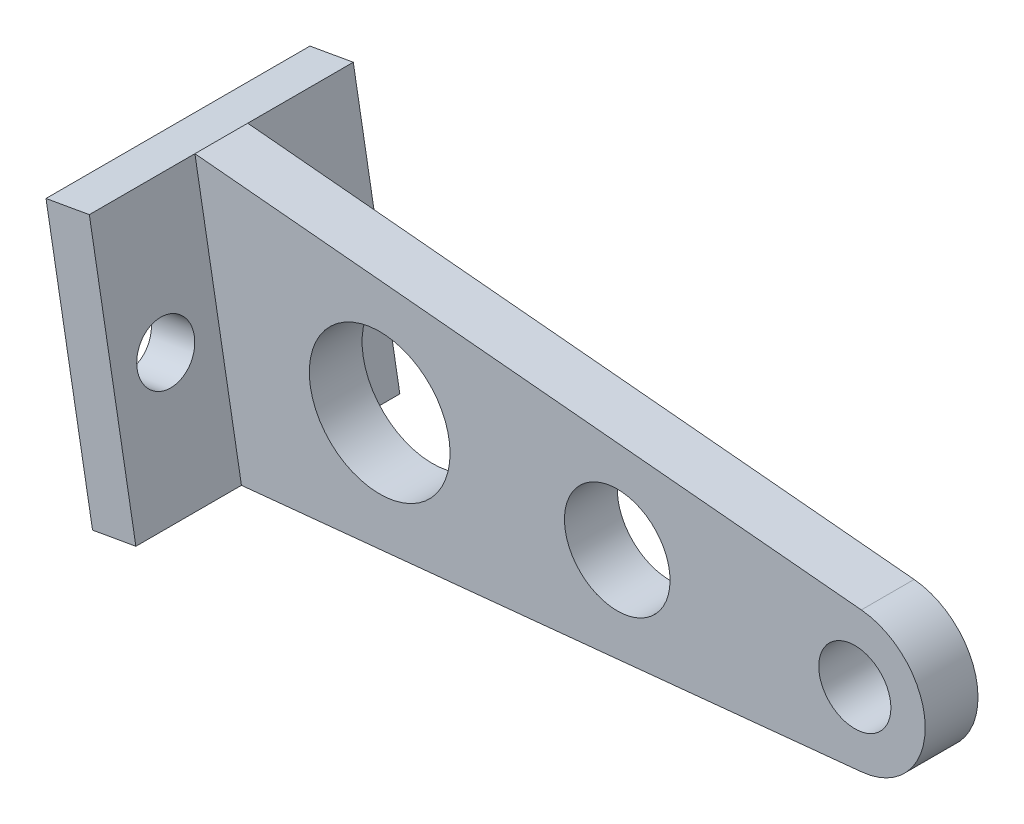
ISO-10303-21;
HEADER;
FILE_DESCRIPTION(('STEP AP214'),'2;1');
FILE_NAME('part.step','',(''),(''),'','','');
FILE_SCHEMA(('AUTOMOTIVE_DESIGN { 1 0 10303 214 1 1 1 1 }'));
ENDSEC;
DATA;
#1=APPLICATION_CONTEXT('core data for automotive mechanical design processes');
#2=APPLICATION_PROTOCOL_DEFINITION('international standard','automotive_design',2000,#1);
#3=PRODUCT_CONTEXT('',#1,'mechanical');
#4=PRODUCT('Part','Part','',(#3));
#5=PRODUCT_RELATED_PRODUCT_CATEGORY('part','',(#4));
#6=PRODUCT_DEFINITION_FORMATION('','',#4);
#7=PRODUCT_DEFINITION_CONTEXT('part definition',#1,'design');
#8=PRODUCT_DEFINITION('design','',#6,#7);
#9=PRODUCT_DEFINITION_SHAPE('','',#8);
#10=(LENGTH_UNIT() NAMED_UNIT(*) SI_UNIT(.MILLI.,.METRE.));
#11=(NAMED_UNIT(*) PLANE_ANGLE_UNIT() SI_UNIT($,.RADIAN.));
#12=(NAMED_UNIT(*) SI_UNIT($,.STERADIAN.) SOLID_ANGLE_UNIT());
#13=UNCERTAINTY_MEASURE_WITH_UNIT(LENGTH_MEASURE(1.E-05),#10,'distance_accuracy_value','');
#14=(GEOMETRIC_REPRESENTATION_CONTEXT(3) GLOBAL_UNCERTAINTY_ASSIGNED_CONTEXT((#13)) GLOBAL_UNIT_ASSIGNED_CONTEXT((#10,
#11,#12)) REPRESENTATION_CONTEXT('',''));
#15=CARTESIAN_POINT('',(0.,0.,0.));
#16=DIRECTION('',(0.,0.,1.));
#17=DIRECTION('',(1.,0.,0.));
#18=AXIS2_PLACEMENT_3D('',#15,#16,#17);
#19=CARTESIAN_POINT('',(54.,0.,3.));
#20=DIRECTION('',(0.,0.,1.));
#21=DIRECTION('',(1.,0.,0.));
#22=AXIS2_PLACEMENT_3D('',#19,#20,#21);
#23=PLANE('',#22);
#24=CARTESIAN_POINT('',(27.,0.,3.));
#25=DIRECTION('',(0.,0.,1.));
#26=DIRECTION('',(1.,0.,0.));
#27=AXIS2_PLACEMENT_3D('',#24,#25,#26);
#28=CIRCLE('',#27,6.);
#29=CARTESIAN_POINT('',(33.,0.,3.));
#30=VERTEX_POINT('',#29);
#31=EDGE_CURVE('E161',#30,#30,#28,.T.);
#32=ORIENTED_EDGE('',*,*,#31,.F.);
#33=EDGE_LOOP('',(#32));
#34=FACE_BOUND('',#33,.T.);
#35=CARTESIAN_POINT('',(54.,0.,3.));
#36=DIRECTION('',(0.,0.,1.));
#37=DIRECTION('',(1.,0.,0.));
#38=AXIS2_PLACEMENT_3D('',#35,#36,#37);
#39=CIRCLE('',#38,8.);
#40=CARTESIAN_POINT('',(54.7948090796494,-7.96041949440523,3.));
#41=VERTEX_POINT('',#40);
#42=CARTESIAN_POINT('',(54.739810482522,7.96571907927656,3.));
#43=VERTEX_POINT('',#42);
#44=EDGE_CURVE('E181',#41,#43,#39,.T.);
#45=ORIENTED_EDGE('',*,*,#44,.T.);
#46=DIRECTION('',(-0.99571488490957,0.0924763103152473,0.));
#47=VECTOR('',#46,1.);
#48=CARTESIAN_POINT('',(54.739810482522,7.96571907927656,3.));
#49=LINE('',#48,#47);
#50=CARTESIAN_POINT('',(-21.,15.,3.));
#51=VERTEX_POINT('',#50);
#52=EDGE_CURVE('E56',#43,#51,#49,.T.);
#53=ORIENTED_EDGE('',*,*,#52,.T.);
#54=DIRECTION('',(0.173648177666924,-0.984807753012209,0.));
#55=VECTOR('',#54,1.);
#56=CARTESIAN_POINT('',(-15.7101905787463,-15.,3.));
#57=LINE('',#56,#55);
#58=CARTESIAN_POINT('',(-15.7101905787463,-15.,3.));
#59=VERTEX_POINT('',#58);
#60=EDGE_CURVE('E106',#51,#59,#57,.T.);
#61=ORIENTED_EDGE('',*,*,#60,.T.);
#62=DIRECTION('',(0.995052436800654,0.0993511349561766,0.));
#63=VECTOR('',#62,1.);
#64=CARTESIAN_POINT('',(54.7948090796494,-7.96041949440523,3.));
#65=LINE('',#64,#63);
#66=EDGE_CURVE('E49',#59,#41,#65,.T.);
#67=ORIENTED_EDGE('',*,*,#66,.T.);
#68=EDGE_LOOP('',(#45,#53,#61,#67));
#69=FACE_BOUND('',#68,.T.);
#70=CARTESIAN_POINT('',(0.,0.,3.));
#71=DIRECTION('',(0.,0.,1.));
#72=DIRECTION('',(1.,0.,0.));
#73=AXIS2_PLACEMENT_3D('',#70,#71,#72);
#74=CIRCLE('',#73,8.);
#75=CARTESIAN_POINT('',(8.,0.,3.));
#76=VERTEX_POINT('',#75);
#77=EDGE_CURVE('E167',#76,#76,#74,.T.);
#78=ORIENTED_EDGE('',*,*,#77,.F.);
#79=EDGE_LOOP('',(#78));
#80=FACE_BOUND('',#79,.T.);
#81=CARTESIAN_POINT('',(54.,0.,3.));
#82=DIRECTION('',(0.,0.,1.));
#83=DIRECTION('',(1.,0.,0.));
#84=AXIS2_PLACEMENT_3D('',#81,#82,#83);
#85=CIRCLE('',#84,4.09999999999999);
#86=CARTESIAN_POINT('',(58.1,0.,3.));
#87=VERTEX_POINT('',#86);
#88=EDGE_CURVE('E154',#87,#87,#85,.T.);
#89=ORIENTED_EDGE('',*,*,#88,.F.);
#90=EDGE_LOOP('',(#89));
#91=FACE_BOUND('',#90,.T.);
#92=ADVANCED_FACE('F34',(#34,#69,#80,#91),#23,.T.);
#93=CARTESIAN_POINT('',(54.,0.,-3.));
#94=DIRECTION('',(0.,0.,1.));
#95=DIRECTION('',(1.,0.,0.));
#96=AXIS2_PLACEMENT_3D('',#93,#94,#95);
#97=PLANE('',#96);
#98=CARTESIAN_POINT('',(27.,0.,-3.));
#99=DIRECTION('',(0.,0.,1.));
#100=DIRECTION('',(1.,0.,0.));
#101=AXIS2_PLACEMENT_3D('',#98,#99,#100);
#102=CIRCLE('',#101,6.);
#103=CARTESIAN_POINT('',(33.,0.,-3.));
#104=VERTEX_POINT('',#103);
#105=EDGE_CURVE('E158',#104,#104,#102,.T.);
#106=ORIENTED_EDGE('',*,*,#105,.T.);
#107=EDGE_LOOP('',(#106));
#108=FACE_BOUND('',#107,.T.);
#109=CARTESIAN_POINT('',(54.,0.,-3.));
#110=DIRECTION('',(0.,0.,1.));
#111=DIRECTION('',(1.,0.,0.));
#112=AXIS2_PLACEMENT_3D('',#109,#110,#111);
#113=CIRCLE('',#112,8.);
#114=CARTESIAN_POINT('',(54.7948090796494,-7.96041949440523,-3.));
#115=VERTEX_POINT('',#114);
#116=CARTESIAN_POINT('',(54.739810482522,7.96571907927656,-3.));
#117=VERTEX_POINT('',#116);
#118=EDGE_CURVE('E170',#115,#117,#113,.T.);
#119=ORIENTED_EDGE('',*,*,#118,.F.);
#120=DIRECTION('',(0.995052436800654,0.0993511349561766,0.));
#121=VECTOR('',#120,1.);
#122=CARTESIAN_POINT('',(54.7948090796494,-7.96041949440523,-3.));
#123=LINE('',#122,#121);
#124=CARTESIAN_POINT('',(-15.7101905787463,-15.,-3.));
#125=VERTEX_POINT('',#124);
#126=EDGE_CURVE('E179',#125,#115,#123,.T.);
#127=ORIENTED_EDGE('',*,*,#126,.F.);
#128=DIRECTION('',(0.173648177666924,-0.984807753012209,0.));
#129=VECTOR('',#128,1.);
#130=CARTESIAN_POINT('',(-15.7101905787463,-15.,-3.));
#131=LINE('',#130,#129);
#132=CARTESIAN_POINT('',(-21.,15.,-3.));
#133=VERTEX_POINT('',#132);
#134=EDGE_CURVE('E176',#133,#125,#131,.T.);
#135=ORIENTED_EDGE('',*,*,#134,.F.);
#136=DIRECTION('',(-0.99571488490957,0.0924763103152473,0.));
#137=VECTOR('',#136,1.);
#138=CARTESIAN_POINT('',(54.739810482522,7.96571907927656,-3.));
#139=LINE('',#138,#137);
#140=EDGE_CURVE('E173',#117,#133,#139,.T.);
#141=ORIENTED_EDGE('',*,*,#140,.F.);
#142=EDGE_LOOP('',(#119,#127,#135,#141));
#143=FACE_BOUND('',#142,.T.);
#144=CARTESIAN_POINT('',(0.,0.,-3.));
#145=DIRECTION('',(0.,0.,1.));
#146=DIRECTION('',(1.,0.,0.));
#147=AXIS2_PLACEMENT_3D('',#144,#145,#146);
#148=CIRCLE('',#147,8.);
#149=CARTESIAN_POINT('',(8.,0.,-3.));
#150=VERTEX_POINT('',#149);
#151=EDGE_CURVE('E164',#150,#150,#148,.T.);
#152=ORIENTED_EDGE('',*,*,#151,.T.);
#153=EDGE_LOOP('',(#152));
#154=FACE_BOUND('',#153,.T.);
#155=CARTESIAN_POINT('',(54.,0.,-3.));
#156=DIRECTION('',(0.,0.,1.));
#157=DIRECTION('',(1.,0.,0.));
#158=AXIS2_PLACEMENT_3D('',#155,#156,#157);
#159=CIRCLE('',#158,4.09999999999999);
#160=CARTESIAN_POINT('',(58.1,0.,-3.));
#161=VERTEX_POINT('',#160);
#162=EDGE_CURVE('E120',#161,#161,#159,.T.);
#163=ORIENTED_EDGE('',*,*,#162,.T.);
#164=EDGE_LOOP('',(#163));
#165=FACE_BOUND('',#164,.T.);
#166=ADVANCED_FACE('F197',(#108,#143,#154,#165),#97,.F.);
#167=CARTESIAN_POINT('',(54.,0.,3.));
#168=DIRECTION('',(0.,0.,-1.));
#169=DIRECTION('',(-1.,0.,0.));
#170=AXIS2_PLACEMENT_3D('',#167,#168,#169);
#171=CYLINDRICAL_SURFACE('',#170,8.);
#172=ORIENTED_EDGE('',*,*,#118,.T.);
#173=DIRECTION('',(0.,0.,-1.));
#174=VECTOR('',#173,1.);
#175=CARTESIAN_POINT('',(54.739810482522,7.96571907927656,3.));
#176=LINE('',#175,#174);
#177=EDGE_CURVE('E11',#43,#117,#176,.T.);
#178=ORIENTED_EDGE('',*,*,#177,.F.);
#179=ORIENTED_EDGE('',*,*,#44,.F.);
#180=DIRECTION('',(0.,0.,-1.));
#181=VECTOR('',#180,1.);
#182=CARTESIAN_POINT('',(54.7948090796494,-7.96041949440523,3.));
#183=LINE('',#182,#181);
#184=EDGE_CURVE('E186',#41,#115,#183,.T.);
#185=ORIENTED_EDGE('',*,*,#184,.T.);
#186=EDGE_LOOP('',(#172,#178,#179,#185));
#187=FACE_BOUND('',#186,.T.);
#188=ADVANCED_FACE('F36',(#187),#171,.T.);
#189=CARTESIAN_POINT('',(54.739810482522,7.96571907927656,3.));
#190=DIRECTION('',(-0.0924763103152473,-0.99571488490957,0.));
#191=DIRECTION('',(0.99571488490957,-0.0924763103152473,0.));
#192=AXIS2_PLACEMENT_3D('',#189,#190,#191);
#193=PLANE('',#192);
#194=ORIENTED_EDGE('',*,*,#140,.T.);
#195=DIRECTION('',(0.,0.,-1.));
#196=VECTOR('',#195,1.);
#197=CARTESIAN_POINT('',(-21.,15.,3.));
#198=LINE('',#197,#196);
#199=EDGE_CURVE('E42',#51,#133,#198,.T.);
#200=ORIENTED_EDGE('',*,*,#199,.F.);
#201=ORIENTED_EDGE('',*,*,#52,.F.);
#202=ORIENTED_EDGE('',*,*,#177,.T.);
#203=EDGE_LOOP('',(#194,#200,#201,#202));
#204=FACE_BOUND('',#203,.T.);
#205=ADVANCED_FACE('F192',(#204),#193,.F.);
#206=CARTESIAN_POINT('',(54.7948090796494,-7.96041949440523,3.));
#207=DIRECTION('',(-0.0993511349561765,0.995052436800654,0.));
#208=DIRECTION('',(-0.995052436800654,-0.0993511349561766,0.));
#209=AXIS2_PLACEMENT_3D('',#206,#207,#208);
#210=PLANE('',#209);
#211=ORIENTED_EDGE('',*,*,#126,.T.);
#212=ORIENTED_EDGE('',*,*,#184,.F.);
#213=ORIENTED_EDGE('',*,*,#66,.F.);
#214=DIRECTION('',(0.,0.,-1.));
#215=VECTOR('',#214,1.);
#216=CARTESIAN_POINT('',(-15.7101905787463,-15.,3.));
#217=LINE('',#216,#215);
#218=EDGE_CURVE('E189',#59,#125,#217,.T.);
#219=ORIENTED_EDGE('',*,*,#218,.T.);
#220=EDGE_LOOP('',(#211,#212,#213,#219));
#221=FACE_BOUND('',#220,.T.);
#222=ADVANCED_FACE('F205',(#221),#210,.F.);
#223=CARTESIAN_POINT('',(0.,0.,3.));
#224=DIRECTION('',(0.,0.,-1.));
#225=DIRECTION('',(-1.,0.,0.));
#226=AXIS2_PLACEMENT_3D('',#223,#224,#225);
#227=CYLINDRICAL_SURFACE('',#226,8.);
#228=ORIENTED_EDGE('',*,*,#77,.T.);
#229=EDGE_LOOP('',(#228));
#230=FACE_BOUND('',#229,.T.);
#231=ORIENTED_EDGE('',*,*,#151,.F.);
#232=EDGE_LOOP('',(#231));
#233=FACE_BOUND('',#232,.T.);
#234=ADVANCED_FACE('F227',(#230,#233),#227,.F.);
#235=CARTESIAN_POINT('',(27.,0.,3.));
#236=DIRECTION('',(0.,0.,-1.));
#237=DIRECTION('',(-1.,0.,0.));
#238=AXIS2_PLACEMENT_3D('',#235,#236,#237);
#239=CYLINDRICAL_SURFACE('',#238,6.);
#240=ORIENTED_EDGE('',*,*,#31,.T.);
#241=EDGE_LOOP('',(#240));
#242=FACE_BOUND('',#241,.T.);
#243=ORIENTED_EDGE('',*,*,#105,.F.);
#244=EDGE_LOOP('',(#243));
#245=FACE_BOUND('',#244,.T.);
#246=ADVANCED_FACE('F231',(#242,#245),#239,.F.);
#247=CARTESIAN_POINT('',(54.,0.,3.));
#248=DIRECTION('',(0.,0.,-1.));
#249=DIRECTION('',(-1.,0.,0.));
#250=AXIS2_PLACEMENT_3D('',#247,#248,#249);
#251=CYLINDRICAL_SURFACE('',#250,4.09999999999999);
#252=ORIENTED_EDGE('',*,*,#88,.T.);
#253=EDGE_LOOP('',(#252));
#254=FACE_BOUND('',#253,.T.);
#255=ORIENTED_EDGE('',*,*,#162,.F.);
#256=EDGE_LOOP('',(#255));
#257=FACE_BOUND('',#256,.T.);
#258=ADVANCED_FACE('F236',(#254,#257),#251,.F.);
#259=CARTESIAN_POINT('',(-15.7101905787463,-15.,15.));
#260=DIRECTION('',(0.984807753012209,0.173648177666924,0.));
#261=DIRECTION('',(-0.173648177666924,0.984807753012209,0.));
#262=AXIS2_PLACEMENT_3D('',#259,#260,#261);
#263=PLANE('',#262);
#264=CARTESIAN_POINT('',(-18.3149132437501,-0.22788370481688,-9.));
#265=DIRECTION('',(-0.984807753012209,-0.173648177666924,0.));
#266=DIRECTION('',(0.173648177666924,-0.984807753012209,0.));
#267=AXIS2_PLACEMENT_3D('',#264,#265,#266);
#268=CIRCLE('',#267,3.25);
#269=CARTESIAN_POINT('',(-17.7505566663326,-3.42850890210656,-9.));
#270=VERTEX_POINT('',#269);
#271=EDGE_CURVE('E273',#270,#270,#268,.T.);
#272=ORIENTED_EDGE('',*,*,#271,.T.);
#273=EDGE_LOOP('',(#272));
#274=FACE_BOUND('',#273,.T.);
#275=ORIENTED_EDGE('',*,*,#134,.T.);
#276=DIRECTION('',(0.,0.,1.));
#277=VECTOR('',#276,1.);
#278=CARTESIAN_POINT('',(-15.7101905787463,-15.,15.));
#279=LINE('',#278,#277);
#280=CARTESIAN_POINT('',(-15.7101905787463,-15.,-15.));
#281=VERTEX_POINT('',#280);
#282=EDGE_CURVE('E136',#281,#125,#279,.T.);
#283=ORIENTED_EDGE('',*,*,#282,.F.);
#284=DIRECTION('',(0.173648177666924,-0.984807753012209,0.));
#285=VECTOR('',#284,1.);
#286=CARTESIAN_POINT('',(-21.,15.,-15.));
#287=LINE('',#286,#285);
#288=CARTESIAN_POINT('',(-21.,15.,-15.));
#289=VERTEX_POINT('',#288);
#290=EDGE_CURVE('E109',#289,#281,#287,.T.);
#291=ORIENTED_EDGE('',*,*,#290,.F.);
#292=DIRECTION('',(0.,0.,-1.));
#293=VECTOR('',#292,1.);
#294=CARTESIAN_POINT('',(-21.,15.,15.));
#295=LINE('',#294,#293);
#296=EDGE_CURVE('E110',#133,#289,#295,.T.);
#297=ORIENTED_EDGE('',*,*,#296,.F.);
#298=EDGE_LOOP('',(#275,#283,#291,#297));
#299=FACE_BOUND('',#298,.T.);
#300=ADVANCED_FACE('F201',(#274,#299),#263,.T.);
#301=CARTESIAN_POINT('',(-25.9240387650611,14.1317591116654,15.));
#302=DIRECTION('',(0.,0.,-1.));
#303=DIRECTION('',(0.,1.,0.));
#304=AXIS2_PLACEMENT_3D('',#301,#302,#303);
#305=PLANE('',#304);
#306=DIRECTION('',(-0.173648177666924,0.984807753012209,0.));
#307=VECTOR('',#306,1.);
#308=CARTESIAN_POINT('',(-21.,15.,15.));
#309=LINE('',#308,#307);
#310=CARTESIAN_POINT('',(-15.7101905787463,-15.,15.));
#311=VERTEX_POINT('',#310);
#312=CARTESIAN_POINT('',(-21.,15.,15.));
#313=VERTEX_POINT('',#312);
#314=EDGE_CURVE('E105',#311,#313,#309,.T.);
#315=ORIENTED_EDGE('',*,*,#314,.T.);
#316=DIRECTION('',(0.984807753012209,0.173648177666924,0.));
#317=VECTOR('',#316,1.);
#318=CARTESIAN_POINT('',(-25.9240387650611,14.1317591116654,15.));
#319=LINE('',#318,#317);
#320=CARTESIAN_POINT('',(-25.9240387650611,14.1317591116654,15.));
#321=VERTEX_POINT('',#320);
#322=EDGE_CURVE('E113',#321,#313,#319,.T.);
#323=ORIENTED_EDGE('',*,*,#322,.F.);
#324=DIRECTION('',(-0.173648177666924,0.984807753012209,0.));
#325=VECTOR('',#324,1.);
#326=CARTESIAN_POINT('',(-25.9240387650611,14.1317591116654,15.));
#327=LINE('',#326,#325);
#328=CARTESIAN_POINT('',(-20.6342293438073,-15.8682408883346,15.));
#329=VERTEX_POINT('',#328);
#330=EDGE_CURVE('E138',#329,#321,#327,.T.);
#331=ORIENTED_EDGE('',*,*,#330,.F.);
#332=DIRECTION('',(0.984807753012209,0.173648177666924,0.));
#333=VECTOR('',#332,1.);
#334=CARTESIAN_POINT('',(-20.6342293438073,-15.8682408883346,15.));
#335=LINE('',#334,#333);
#336=EDGE_CURVE('E126',#329,#311,#335,.T.);
#337=ORIENTED_EDGE('',*,*,#336,.T.);
#338=EDGE_LOOP('',(#315,#323,#331,#337));
#339=FACE_BOUND('',#338,.T.);
#340=ADVANCED_FACE('F124',(#339),#305,.F.);
#341=CARTESIAN_POINT('',(-25.9240387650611,14.1317591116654,15.));
#342=DIRECTION('',(0.173648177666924,-0.984807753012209,0.));
#343=DIRECTION('',(0.984807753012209,0.173648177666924,0.));
#344=AXIS2_PLACEMENT_3D('',#341,#342,#343);
#345=PLANE('',#344);
#346=EDGE_CURVE('E101',#313,#51,#295,.T.);
#347=ORIENTED_EDGE('',*,*,#346,.T.);
#348=ORIENTED_EDGE('',*,*,#199,.T.);
#349=ORIENTED_EDGE('',*,*,#296,.T.);
#350=DIRECTION('',(0.984807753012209,0.173648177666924,0.));
#351=VECTOR('',#350,1.);
#352=CARTESIAN_POINT('',(-25.9240387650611,14.1317591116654,-15.));
#353=LINE('',#352,#351);
#354=CARTESIAN_POINT('',(-25.9240387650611,14.1317591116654,-15.));
#355=VERTEX_POINT('',#354);
#356=EDGE_CURVE('E121',#355,#289,#353,.T.);
#357=ORIENTED_EDGE('',*,*,#356,.F.);
#358=DIRECTION('',(0.,0.,-1.));
#359=VECTOR('',#358,1.);
#360=CARTESIAN_POINT('',(-25.9240387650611,14.1317591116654,15.));
#361=LINE('',#360,#359);
#362=EDGE_CURVE('E116',#321,#355,#361,.T.);
#363=ORIENTED_EDGE('',*,*,#362,.F.);
#364=ORIENTED_EDGE('',*,*,#322,.T.);
#365=EDGE_LOOP('',(#347,#348,#349,#357,#363,#364));
#366=FACE_BOUND('',#365,.T.);
#367=ADVANCED_FACE('F114',(#366),#345,.F.);
#368=CARTESIAN_POINT('',(-25.9240387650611,14.1317591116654,-15.));
#369=DIRECTION('',(0.,0.,1.));
#370=DIRECTION('',(0.,-1.,0.));
#371=AXIS2_PLACEMENT_3D('',#368,#369,#370);
#372=PLANE('',#371);
#373=ORIENTED_EDGE('',*,*,#290,.T.);
#374=DIRECTION('',(0.984807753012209,0.173648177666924,0.));
#375=VECTOR('',#374,1.);
#376=CARTESIAN_POINT('',(-20.6342293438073,-15.8682408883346,-15.));
#377=LINE('',#376,#375);
#378=CARTESIAN_POINT('',(-20.6342293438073,-15.8682408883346,-15.));
#379=VERTEX_POINT('',#378);
#380=EDGE_CURVE('E146',#379,#281,#377,.T.);
#381=ORIENTED_EDGE('',*,*,#380,.F.);
#382=DIRECTION('',(0.173648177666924,-0.984807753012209,0.));
#383=VECTOR('',#382,1.);
#384=CARTESIAN_POINT('',(-25.9240387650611,14.1317591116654,-15.));
#385=LINE('',#384,#383);
#386=EDGE_CURVE('E141',#355,#379,#385,.T.);
#387=ORIENTED_EDGE('',*,*,#386,.F.);
#388=ORIENTED_EDGE('',*,*,#356,.T.);
#389=EDGE_LOOP('',(#373,#381,#387,#388));
#390=FACE_BOUND('',#389,.T.);
#391=ADVANCED_FACE('F248',(#390),#372,.F.);
#392=CARTESIAN_POINT('',(-20.6342293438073,-15.8682408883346,15.));
#393=DIRECTION('',(-0.173648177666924,0.984807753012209,0.));
#394=DIRECTION('',(-0.984807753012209,-0.173648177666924,0.));
#395=AXIS2_PLACEMENT_3D('',#392,#393,#394);
#396=PLANE('',#395);
#397=ORIENTED_EDGE('',*,*,#282,.T.);
#398=ORIENTED_EDGE('',*,*,#218,.F.);
#399=EDGE_CURVE('E135',#59,#311,#279,.T.);
#400=ORIENTED_EDGE('',*,*,#399,.T.);
#401=ORIENTED_EDGE('',*,*,#336,.F.);
#402=DIRECTION('',(0.,0.,1.));
#403=VECTOR('',#402,1.);
#404=CARTESIAN_POINT('',(-20.6342293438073,-15.8682408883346,15.));
#405=LINE('',#404,#403);
#406=EDGE_CURVE('E143',#379,#329,#405,.T.);
#407=ORIENTED_EDGE('',*,*,#406,.F.);
#408=ORIENTED_EDGE('',*,*,#380,.T.);
#409=EDGE_LOOP('',(#397,#398,#400,#401,#407,#408));
#410=FACE_BOUND('',#409,.T.);
#411=ADVANCED_FACE('F207',(#410),#396,.F.);
#412=CARTESIAN_POINT('',(-20.6342293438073,-15.8682408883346,15.));
#413=DIRECTION('',(0.984807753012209,0.173648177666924,0.));
#414=DIRECTION('',(-0.173648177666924,0.984807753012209,0.));
#415=AXIS2_PLACEMENT_3D('',#412,#413,#414);
#416=PLANE('',#415);
#417=CARTESIAN_POINT('',(-23.2389520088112,-1.0961245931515,-9.));
#418=DIRECTION('',(-0.984807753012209,-0.173648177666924,0.));
#419=DIRECTION('',(0.173648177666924,-0.984807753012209,0.));
#420=AXIS2_PLACEMENT_3D('',#417,#418,#419);
#421=CIRCLE('',#420,3.25);
#422=CARTESIAN_POINT('',(-22.6745954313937,-4.29674979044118,-9.));
#423=VERTEX_POINT('',#422);
#424=EDGE_CURVE('E276',#423,#423,#421,.T.);
#425=ORIENTED_EDGE('',*,*,#424,.F.);
#426=EDGE_LOOP('',(#425));
#427=FACE_BOUND('',#426,.T.);
#428=CARTESIAN_POINT('',(-23.2389520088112,-1.0961245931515,9.));
#429=DIRECTION('',(-0.984807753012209,-0.173648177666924,0.));
#430=DIRECTION('',(0.173648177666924,-0.984807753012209,0.));
#431=AXIS2_PLACEMENT_3D('',#428,#429,#430);
#432=CIRCLE('',#431,3.25);
#433=CARTESIAN_POINT('',(-22.6745954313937,-4.29674979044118,9.));
#434=VERTEX_POINT('',#433);
#435=EDGE_CURVE('E130',#434,#434,#432,.T.);
#436=ORIENTED_EDGE('',*,*,#435,.F.);
#437=EDGE_LOOP('',(#436));
#438=FACE_BOUND('',#437,.T.);
#439=ORIENTED_EDGE('',*,*,#330,.T.);
#440=ORIENTED_EDGE('',*,*,#362,.T.);
#441=ORIENTED_EDGE('',*,*,#386,.T.);
#442=ORIENTED_EDGE('',*,*,#406,.T.);
#443=EDGE_LOOP('',(#439,#440,#441,#442));
#444=FACE_BOUND('',#443,.T.);
#445=ADVANCED_FACE('F254',(#427,#438,#444),#416,.F.);
#446=CARTESIAN_POINT('',(-18.3149132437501,-0.227883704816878,9.));
#447=DIRECTION('',(-0.984807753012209,-0.173648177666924,0.));
#448=DIRECTION('',(0.173648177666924,-0.984807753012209,0.));
#449=AXIS2_PLACEMENT_3D('',#446,#447,#448);
#450=CIRCLE('',#449,3.25);
#451=CARTESIAN_POINT('',(-17.7505566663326,-3.42850890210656,9.));
#452=VERTEX_POINT('',#451);
#453=EDGE_CURVE('E127',#452,#452,#450,.T.);
#454=ORIENTED_EDGE('',*,*,#453,.T.);
#455=EDGE_LOOP('',(#454));
#456=FACE_BOUND('',#455,.T.);
#457=ORIENTED_EDGE('',*,*,#399,.F.);
#458=ORIENTED_EDGE('',*,*,#60,.F.);
#459=ORIENTED_EDGE('',*,*,#346,.F.);
#460=ORIENTED_EDGE('',*,*,#314,.F.);
#461=EDGE_LOOP('',(#457,#458,#459,#460));
#462=FACE_BOUND('',#461,.T.);
#463=ADVANCED_FACE('F103',(#456,#462),#263,.T.);
#464=CARTESIAN_POINT('',(-18.3149132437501,-0.227883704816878,9.));
#465=DIRECTION('',(-0.984807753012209,-0.173648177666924,0.));
#466=DIRECTION('',(0.173648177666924,-0.984807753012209,0.));
#467=AXIS2_PLACEMENT_3D('',#464,#465,#466);
#468=CYLINDRICAL_SURFACE('',#467,3.25);
#469=ORIENTED_EDGE('',*,*,#453,.F.);
#470=EDGE_LOOP('',(#469));
#471=FACE_BOUND('',#470,.T.);
#472=ORIENTED_EDGE('',*,*,#435,.T.);
#473=EDGE_LOOP('',(#472));
#474=FACE_BOUND('',#473,.T.);
#475=ADVANCED_FACE('F260',(#471,#474),#468,.F.);
#476=CARTESIAN_POINT('',(-18.3149132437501,-0.22788370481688,-9.));
#477=DIRECTION('',(-0.984807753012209,-0.173648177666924,0.));
#478=DIRECTION('',(0.173648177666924,-0.984807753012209,0.));
#479=AXIS2_PLACEMENT_3D('',#476,#477,#478);
#480=CYLINDRICAL_SURFACE('',#479,3.25);
#481=ORIENTED_EDGE('',*,*,#271,.F.);
#482=EDGE_LOOP('',(#481));
#483=FACE_BOUND('',#482,.T.);
#484=ORIENTED_EDGE('',*,*,#424,.T.);
#485=EDGE_LOOP('',(#484));
#486=FACE_BOUND('',#485,.T.);
#487=ADVANCED_FACE('F264',(#483,#486),#480,.F.);
#488=CLOSED_SHELL('',(#92,#166,#188,#205,#222,#234,#246,#258,#300,#340,#367,#391,#411,#445,#463,
#475,#487));
#489=MANIFOLD_SOLID_BREP('B2',#488);
#490=ADVANCED_BREP_SHAPE_REPRESENTATION('',(#18,#489),#14);
#491=SHAPE_DEFINITION_REPRESENTATION(#9,#490);
ENDSEC;
END-ISO-10303-21;
